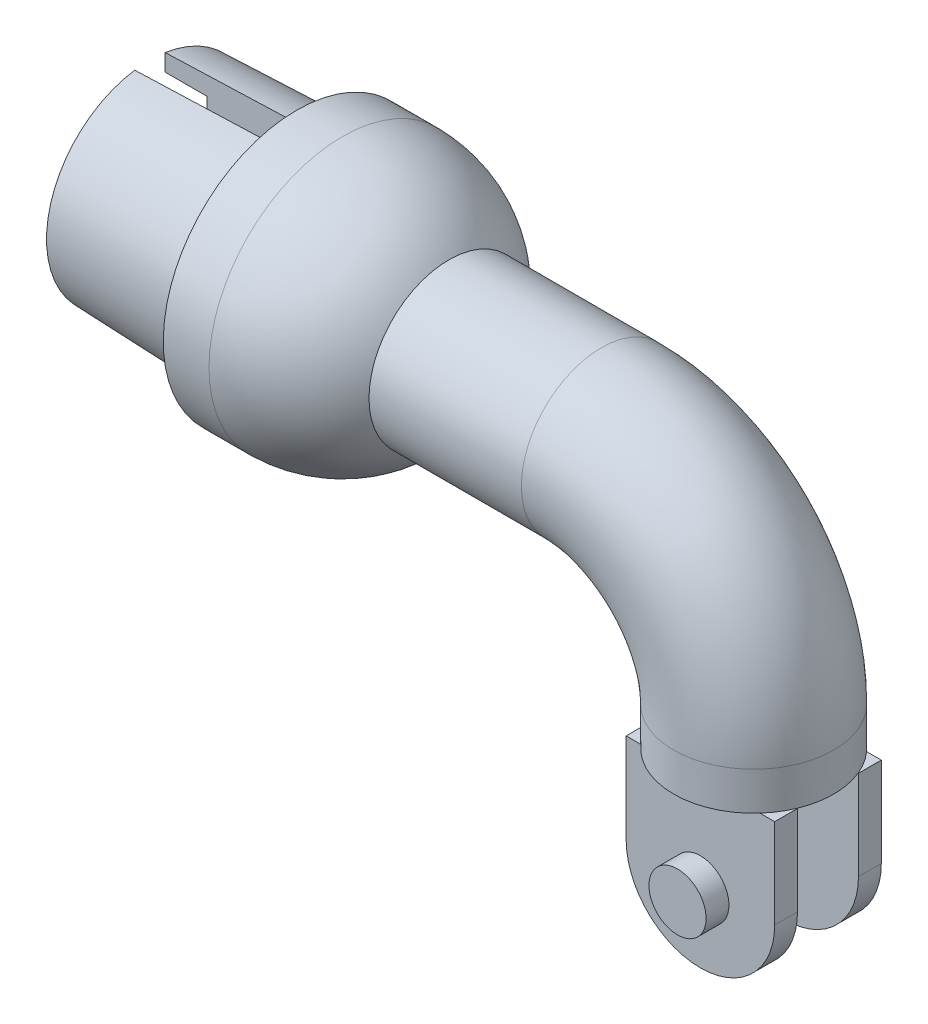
ISO-10303-21;
HEADER;
FILE_DESCRIPTION(('STEP AP214'),'2;1');
FILE_NAME('part.step','',(''),(''),'','','');
FILE_SCHEMA(('AUTOMOTIVE_DESIGN { 1 0 10303 214 1 1 1 1 }'));
ENDSEC;
DATA;
#1=APPLICATION_CONTEXT('core data for automotive mechanical design processes');
#2=APPLICATION_PROTOCOL_DEFINITION('international standard','automotive_design',2000,#1);
#3=PRODUCT_CONTEXT('',#1,'mechanical');
#4=PRODUCT('Part','Part','',(#3));
#5=PRODUCT_RELATED_PRODUCT_CATEGORY('part','',(#4));
#6=PRODUCT_DEFINITION_FORMATION('','',#4);
#7=PRODUCT_DEFINITION_CONTEXT('part definition',#1,'design');
#8=PRODUCT_DEFINITION('design','',#6,#7);
#9=PRODUCT_DEFINITION_SHAPE('','',#8);
#10=(LENGTH_UNIT() NAMED_UNIT(*) SI_UNIT(.MILLI.,.METRE.));
#11=(NAMED_UNIT(*) PLANE_ANGLE_UNIT() SI_UNIT($,.RADIAN.));
#12=(NAMED_UNIT(*) SI_UNIT($,.STERADIAN.) SOLID_ANGLE_UNIT());
#13=UNCERTAINTY_MEASURE_WITH_UNIT(LENGTH_MEASURE(1.E-05),#10,'distance_accuracy_value','');
#14=(GEOMETRIC_REPRESENTATION_CONTEXT(3) GLOBAL_UNCERTAINTY_ASSIGNED_CONTEXT((#13)) GLOBAL_UNIT_ASSIGNED_CONTEXT((#10,
#11,#12)) REPRESENTATION_CONTEXT('',''));
#15=CARTESIAN_POINT('',(0.,0.,0.));
#16=DIRECTION('',(0.,0.,1.));
#17=DIRECTION('',(1.,0.,0.));
#18=AXIS2_PLACEMENT_3D('',#15,#16,#17);
#19=CARTESIAN_POINT('',(0.,6.35,0.));
#20=DIRECTION('',(0.,1.,0.));
#21=DIRECTION('',(0.,0.,1.));
#22=AXIS2_PLACEMENT_3D('',#19,#20,#21);
#23=PLANE('',#22);
#24=CARTESIAN_POINT('',(0.,6.35,0.));
#25=DIRECTION('',(0.,1.,0.));
#26=DIRECTION('',(0.,0.,1.));
#27=AXIS2_PLACEMENT_3D('',#24,#25,#26);
#28=CIRCLE('',#27,5.334);
#29=CARTESIAN_POINT('',(4.93178791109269,6.35,2.032));
#30=VERTEX_POINT('',#29);
#31=CARTESIAN_POINT('',(4.93178791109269,6.35,-2.032));
#32=VERTEX_POINT('',#31);
#33=EDGE_CURVE('E43',#30,#32,#28,.T.);
#34=ORIENTED_EDGE('',*,*,#33,.F.);
#35=DIRECTION('',(1.,0.,0.));
#36=VECTOR('',#35,1.);
#37=CARTESIAN_POINT('',(-4.953,6.34999999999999,2.032));
#38=LINE('',#37,#36);
#39=CARTESIAN_POINT('',(2.60272549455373,6.34999999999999,2.032));
#40=VERTEX_POINT('',#39);
#41=EDGE_CURVE('E550',#40,#30,#38,.T.);
#42=ORIENTED_EDGE('',*,*,#41,.F.);
#43=CARTESIAN_POINT('',(0.,6.35,0.));
#44=DIRECTION('',(0.,1.,0.));
#45=DIRECTION('',(0.,0.,1.));
#46=AXIS2_PLACEMENT_3D('',#43,#44,#45);
#47=CIRCLE('',#46,3.302);
#48=CARTESIAN_POINT('',(2.60272549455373,6.34999999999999,-2.032));
#49=VERTEX_POINT('',#48);
#50=EDGE_CURVE('E453',#40,#49,#47,.T.);
#51=ORIENTED_EDGE('',*,*,#50,.T.);
#52=DIRECTION('',(1.,0.,0.));
#53=VECTOR('',#52,1.);
#54=CARTESIAN_POINT('',(-4.953,6.34999999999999,-2.032));
#55=LINE('',#54,#53);
#56=EDGE_CURVE('E286',#49,#32,#55,.T.);
#57=ORIENTED_EDGE('',*,*,#56,.T.);
#58=EDGE_LOOP('',(#34,#42,#51,#57));
#59=FACE_BOUND('',#58,.T.);
#60=ADVANCED_FACE('F28',(#59),#23,.F.);
#61=DIRECTION('',(1.,0.,0.));
#62=VECTOR('',#61,1.);
#63=CARTESIAN_POINT('',(-4.953,6.34999999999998,3.556));
#64=LINE('',#63,#62);
#65=CARTESIAN_POINT('',(-3.97572886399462,6.35,3.556));
#66=VERTEX_POINT('',#65);
#67=CARTESIAN_POINT('',(3.97572886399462,6.35,3.556));
#68=VERTEX_POINT('',#67);
#69=EDGE_CURVE('E50',#66,#68,#64,.T.);
#70=ORIENTED_EDGE('',*,*,#69,.T.);
#71=EDGE_CURVE('E536',#66,#68,#28,.T.);
#72=ORIENTED_EDGE('',*,*,#71,.F.);
#73=EDGE_LOOP('',(#70,#72));
#74=FACE_BOUND('',#73,.T.);
#75=ADVANCED_FACE('F573',(#74),#23,.F.);
#76=CARTESIAN_POINT('',(0.,0.380999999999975,-3.55599999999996));
#77=DIRECTION('',(0.,0.,1.));
#78=DIRECTION('',(0.,-1.,0.));
#79=AXIS2_PLACEMENT_3D('',#76,#77,#78);
#80=PLANE('',#79);
#81=DIRECTION('',(0.,-1.,0.));
#82=VECTOR('',#81,1.);
#83=CARTESIAN_POINT('',(-4.953,6.34999999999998,-3.556));
#84=LINE('',#83,#82);
#85=CARTESIAN_POINT('',(-4.953,6.34999999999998,-3.556));
#86=VERTEX_POINT('',#85);
#87=CARTESIAN_POINT('',(-4.953,0.380999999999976,-3.55599999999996));
#88=VERTEX_POINT('',#87);
#89=EDGE_CURVE('E260',#86,#88,#84,.T.);
#90=ORIENTED_EDGE('',*,*,#89,.F.);
#91=DIRECTION('',(1.,0.,0.));
#92=VECTOR('',#91,1.);
#93=CARTESIAN_POINT('',(-4.953,6.34999999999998,-3.556));
#94=LINE('',#93,#92);
#95=CARTESIAN_POINT('',(-3.97572886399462,6.34999999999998,-3.556));
#96=VERTEX_POINT('',#95);
#97=EDGE_CURVE('E269',#86,#96,#94,.T.);
#98=ORIENTED_EDGE('',*,*,#97,.T.);
#99=CARTESIAN_POINT('',(3.97572886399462,6.34999999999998,-3.556));
#100=VERTEX_POINT('',#99);
#101=EDGE_CURVE('E36',#96,#100,#94,.T.);
#102=ORIENTED_EDGE('',*,*,#101,.T.);
#103=CARTESIAN_POINT('',(4.95299999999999,6.34999999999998,-3.556));
#104=VERTEX_POINT('',#103);
#105=EDGE_CURVE('E268',#100,#104,#94,.T.);
#106=ORIENTED_EDGE('',*,*,#105,.T.);
#107=DIRECTION('',(0.,1.,0.));
#108=VECTOR('',#107,1.);
#109=CARTESIAN_POINT('',(4.953,0.380999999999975,-3.55599999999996));
#110=LINE('',#109,#108);
#111=CARTESIAN_POINT('',(4.953,0.380999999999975,-3.55599999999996));
#112=VERTEX_POINT('',#111);
#113=EDGE_CURVE('E265',#112,#104,#110,.T.);
#114=ORIENTED_EDGE('',*,*,#113,.F.);
#115=CARTESIAN_POINT('',(0.,0.380999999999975,-3.55599999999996));
#116=DIRECTION('',(0.,0.,1.));
#117=DIRECTION('',(0.,-1.,0.));
#118=AXIS2_PLACEMENT_3D('',#115,#116,#117);
#119=CIRCLE('',#118,4.953);
#120=EDGE_CURVE('E263',#88,#112,#119,.T.);
#121=ORIENTED_EDGE('',*,*,#120,.F.);
#122=EDGE_LOOP('',(#90,#98,#102,#106,#114,#121));
#123=FACE_BOUND('',#122,.T.);
#124=CARTESIAN_POINT('',(0.,0.,-3.55599999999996));
#125=DIRECTION('',(0.,0.,1.));
#126=DIRECTION('',(0.,-1.,0.));
#127=AXIS2_PLACEMENT_3D('',#124,#125,#126);
#128=CIRCLE('',#127,1.905);
#129=CARTESIAN_POINT('',(0.,-1.90500000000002,-3.55599999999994));
#130=VERTEX_POINT('',#129);
#131=EDGE_CURVE('E11',#130,#130,#128,.F.);
#132=ORIENTED_EDGE('',*,*,#131,.F.);
#133=EDGE_LOOP('',(#132));
#134=FACE_BOUND('',#133,.T.);
#135=ADVANCED_FACE('F522',(#123,#134),#80,.F.);
#136=ORIENTED_EDGE('',*,*,#101,.F.);
#137=EDGE_CURVE('E481',#100,#96,#28,.T.);
#138=ORIENTED_EDGE('',*,*,#137,.F.);
#139=EDGE_LOOP('',(#136,#138));
#140=FACE_BOUND('',#139,.T.);
#141=ADVANCED_FACE('F529',(#140),#23,.F.);
#142=CARTESIAN_POINT('',(-40.259,19.05,0.));
#143=DIRECTION('',(-1.,0.,0.));
#144=DIRECTION('',(0.,-1.,0.));
#145=AXIS2_PLACEMENT_3D('',#142,#143,#144);
#146=PLANE('',#145);
#147=DIRECTION('',(0.,-1.,0.));
#148=VECTOR('',#147,1.);
#149=CARTESIAN_POINT('',(-40.259,27.94,1.016));
#150=LINE('',#149,#148);
#151=CARTESIAN_POINT('',(-40.259,13.3615198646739,1.016));
#152=VERTEX_POINT('',#151);
#153=CARTESIAN_POINT('',(-40.259,12.2277287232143,1.016));
#154=VERTEX_POINT('',#153);
#155=EDGE_CURVE('E308',#152,#154,#150,.T.);
#156=ORIENTED_EDGE('',*,*,#155,.T.);
#157=CARTESIAN_POINT('',(-40.259,19.05,0.));
#158=DIRECTION('',(-1.,0.,0.));
#159=DIRECTION('',(0.,-1.,0.));
#160=AXIS2_PLACEMENT_3D('',#157,#158,#159);
#161=CIRCLE('',#160,6.8975097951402);
#162=CARTESIAN_POINT('',(-40.259,25.8722712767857,1.016));
#163=VERTEX_POINT('',#162);
#164=EDGE_CURVE('E468',#154,#163,#161,.T.);
#165=ORIENTED_EDGE('',*,*,#164,.T.);
#166=CARTESIAN_POINT('',(-40.259,24.7384801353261,1.016));
#167=VERTEX_POINT('',#166);
#168=EDGE_CURVE('E311',#163,#167,#150,.T.);
#169=ORIENTED_EDGE('',*,*,#168,.T.);
#170=CARTESIAN_POINT('',(-40.259,19.05,0.));
#171=DIRECTION('',(-1.,0.,0.));
#172=DIRECTION('',(0.,-1.,0.));
#173=AXIS2_PLACEMENT_3D('',#170,#171,#172);
#174=CIRCLE('',#173,5.7785);
#175=EDGE_CURVE('E432',#152,#167,#174,.T.);
#176=ORIENTED_EDGE('',*,*,#175,.F.);
#177=EDGE_LOOP('',(#156,#165,#169,#176));
#178=FACE_BOUND('',#177,.T.);
#179=ADVANCED_FACE('F591',(#178),#146,.T.);
#180=CARTESIAN_POINT('',(-37.465,19.05,0.));
#181=DIRECTION('',(-1.,0.,0.));
#182=DIRECTION('',(0.,-1.,0.));
#183=AXIS2_PLACEMENT_3D('',#180,#181,#182);
#184=CYLINDRICAL_SURFACE('',#183,5.7785);
#185=ORIENTED_EDGE('',*,*,#175,.T.);
#186=DIRECTION('',(-1.,0.,0.));
#187=VECTOR('',#186,1.);
#188=CARTESIAN_POINT('',(-37.465,24.7384801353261,1.016));
#189=LINE('',#188,#187);
#190=CARTESIAN_POINT('',(-37.465,24.7384801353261,1.016));
#191=VERTEX_POINT('',#190);
#192=EDGE_CURVE('E406',#167,#191,#189,.F.);
#193=ORIENTED_EDGE('',*,*,#192,.T.);
#194=CARTESIAN_POINT('',(-37.465,19.05,0.));
#195=DIRECTION('',(-1.,0.,0.));
#196=DIRECTION('',(0.,-1.,0.));
#197=AXIS2_PLACEMENT_3D('',#194,#195,#196);
#198=CIRCLE('',#197,5.7785);
#199=CARTESIAN_POINT('',(-37.465,13.3615198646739,1.016));
#200=VERTEX_POINT('',#199);
#201=EDGE_CURVE('E435',#200,#191,#198,.T.);
#202=ORIENTED_EDGE('',*,*,#201,.F.);
#203=DIRECTION('',(-1.,0.,0.));
#204=VECTOR('',#203,1.);
#205=CARTESIAN_POINT('',(-37.465,13.3615198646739,1.016));
#206=LINE('',#205,#204);
#207=EDGE_CURVE('E405',#200,#152,#206,.T.);
#208=ORIENTED_EDGE('',*,*,#207,.T.);
#209=EDGE_LOOP('',(#185,#193,#202,#208));
#210=FACE_BOUND('',#209,.T.);
#211=ADVANCED_FACE('F596',(#210),#184,.F.);
#212=CARTESIAN_POINT('',(-37.465,19.05,0.));
#213=DIRECTION('',(-1.,0.,0.));
#214=DIRECTION('',(0.,-1.,0.));
#215=AXIS2_PLACEMENT_3D('',#212,#213,#214);
#216=PLANE('',#215);
#217=DIRECTION('',(0.,1.,0.));
#218=VECTOR('',#217,1.);
#219=CARTESIAN_POINT('',(-37.465,19.05,1.016));
#220=LINE('',#219,#218);
#221=CARTESIAN_POINT('',(-37.465,14.1932934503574,1.016));
#222=VERTEX_POINT('',#221);
#223=EDGE_CURVE('E416',#200,#222,#220,.T.);
#224=ORIENTED_EDGE('',*,*,#223,.F.);
#225=ORIENTED_EDGE('',*,*,#201,.T.);
#226=CARTESIAN_POINT('',(-37.465,23.9067065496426,1.016));
#227=VERTEX_POINT('',#226);
#228=EDGE_CURVE('E492',#227,#191,#220,.T.);
#229=ORIENTED_EDGE('',*,*,#228,.F.);
#230=CARTESIAN_POINT('',(-37.465,19.05,0.));
#231=DIRECTION('',(-1.,0.,0.));
#232=DIRECTION('',(0.,-1.,0.));
#233=AXIS2_PLACEMENT_3D('',#230,#231,#232);
#234=CIRCLE('',#233,4.96183983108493);
#235=EDGE_CURVE('E457',#222,#227,#234,.T.);
#236=ORIENTED_EDGE('',*,*,#235,.F.);
#237=EDGE_LOOP('',(#224,#225,#229,#236));
#238=FACE_BOUND('',#237,.T.);
#239=ADVANCED_FACE('F653',(#238),#216,.T.);
#240=CARTESIAN_POINT('',(-30.4090842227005,19.05,0.));
#241=DIRECTION('',(1.,0.,0.));
#242=DIRECTION('',(0.,-1.,0.));
#243=AXIS2_PLACEMENT_3D('',#240,#241,#242);
#244=CONICAL_SURFACE('',#243,5.20823783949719,0.0349065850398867);
#245=CARTESIAN_POINT('',(-45.5995649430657,14.483894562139,1.016));
#246=CARTESIAN_POINT('',(-42.3703496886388,14.3683953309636,1.016));
#247=CARTESIAN_POINT('',(-39.1411284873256,14.2530628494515,1.016));
#248=CARTESIAN_POINT('',(-32.6826741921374,14.0227313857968,1.016));
#249=CARTESIAN_POINT('',(-29.4534410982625,13.9077324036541,1.016));
#250=CARTESIAN_POINT('',(-26.2242020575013,13.7929001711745,1.016));
#251=B_SPLINE_CURVE_WITH_KNOTS('',3,(#245,#246,#247,#248,#249,#250),.UNSPECIFIED.,.F.,.F.,(4,2,
4),(0.,9.69384032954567,19.3876806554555),.UNSPECIFIED.);
#252=CARTESIAN_POINT('',(-31.115,13.9669580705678,1.016));
#253=VERTEX_POINT('',#252);
#254=EDGE_CURVE('E381',#222,#253,#251,.T.);
#255=ORIENTED_EDGE('',*,*,#254,.F.);
#256=ORIENTED_EDGE('',*,*,#235,.T.);
#257=CARTESIAN_POINT('',(-26.2242020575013,24.3070998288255,1.016));
#258=CARTESIAN_POINT('',(-29.4534410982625,24.1922675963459,1.016));
#259=CARTESIAN_POINT('',(-32.6826741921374,24.0772686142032,1.016));
#260=CARTESIAN_POINT('',(-39.1411284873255,23.8469371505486,1.016));
#261=CARTESIAN_POINT('',(-42.3703496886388,23.7316046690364,1.016));
#262=CARTESIAN_POINT('',(-45.5995649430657,23.616105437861,1.016));
#263=B_SPLINE_CURVE_WITH_KNOTS('',3,(#257,#258,#259,#260,#261,#262),.UNSPECIFIED.,.F.,.F.,(4,2,
4),(0.,9.69384032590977,19.3876806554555),.UNSPECIFIED.);
#264=CARTESIAN_POINT('',(-31.115,24.1330419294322,1.016));
#265=VERTEX_POINT('',#264);
#266=EDGE_CURVE('E400',#265,#227,#263,.T.);
#267=ORIENTED_EDGE('',*,*,#266,.F.);
#268=CARTESIAN_POINT('',(-31.115,19.05,0.));
#269=DIRECTION('',(1.,0.,0.));
#270=DIRECTION('',(0.,0.,-1.));
#271=AXIS2_PLACEMENT_3D('',#268,#269,#270);
#272=CIRCLE('',#271,5.18358671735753);
#273=CARTESIAN_POINT('',(-31.115,24.1330419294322,-1.016));
#274=VERTEX_POINT('',#273);
#275=EDGE_CURVE('E429',#274,#265,#272,.T.);
#276=ORIENTED_EDGE('',*,*,#275,.F.);
#277=CARTESIAN_POINT('',(-45.5995649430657,23.616105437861,-1.016));
#278=CARTESIAN_POINT('',(-42.3703496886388,23.7316046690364,-1.016));
#279=CARTESIAN_POINT('',(-39.1411284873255,23.8469371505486,-1.016));
#280=CARTESIAN_POINT('',(-32.6826741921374,24.0772686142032,-1.016));
#281=CARTESIAN_POINT('',(-29.4534410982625,24.1922675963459,-1.016));
#282=CARTESIAN_POINT('',(-26.2242020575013,24.3070998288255,-1.016));
#283=B_SPLINE_CURVE_WITH_KNOTS('',3,(#277,#278,#279,#280,#281,#282),.UNSPECIFIED.,.F.,.F.,(4,2,
4),(0.,9.69384032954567,19.3876806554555),.UNSPECIFIED.);
#284=CARTESIAN_POINT('',(-37.465,23.9067065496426,-1.016));
#285=VERTEX_POINT('',#284);
#286=EDGE_CURVE('E345',#285,#274,#283,.T.);
#287=ORIENTED_EDGE('',*,*,#286,.F.);
#288=CARTESIAN_POINT('',(-37.465,14.1932934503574,-1.016));
#289=VERTEX_POINT('',#288);
#290=EDGE_CURVE('E438',#285,#289,#234,.T.);
#291=ORIENTED_EDGE('',*,*,#290,.T.);
#292=CARTESIAN_POINT('',(-26.2242020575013,13.7929001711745,-1.016));
#293=CARTESIAN_POINT('',(-29.4534410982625,13.9077324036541,-1.016));
#294=CARTESIAN_POINT('',(-32.6826741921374,14.0227313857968,-1.016));
#295=CARTESIAN_POINT('',(-39.1411284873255,14.2530628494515,-1.016));
#296=CARTESIAN_POINT('',(-42.3703496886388,14.3683953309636,-1.016));
#297=CARTESIAN_POINT('',(-45.5995649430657,14.483894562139,-1.016));
#298=B_SPLINE_CURVE_WITH_KNOTS('',3,(#292,#293,#294,#295,#296,#297),.UNSPECIFIED.,.F.,.F.,(4,2,
4),(0.,9.69384032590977,19.3876806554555),.UNSPECIFIED.);
#299=CARTESIAN_POINT('',(-31.115,13.9669580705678,-1.016));
#300=VERTEX_POINT('',#299);
#301=EDGE_CURVE('E315',#300,#289,#298,.T.);
#302=ORIENTED_EDGE('',*,*,#301,.F.);
#303=EDGE_CURVE('E422',#253,#300,#272,.T.);
#304=ORIENTED_EDGE('',*,*,#303,.F.);
#305=EDGE_LOOP('',(#255,#256,#267,#276,#287,#291,#302,#304));
#306=FACE_BOUND('',#305,.T.);
#307=CARTESIAN_POINT('',(-28.448,19.05,0.));
#308=DIRECTION('',(-1.,0.,0.));
#309=DIRECTION('',(0.,-1.,0.));
#310=AXIS2_PLACEMENT_3D('',#307,#308,#309);
#311=CIRCLE('',#310,5.27672040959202);
#312=CARTESIAN_POINT('',(-28.448,13.773279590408,0.));
#313=VERTEX_POINT('',#312);
#314=EDGE_CURVE('E442',#313,#313,#311,.T.);
#315=ORIENTED_EDGE('',*,*,#314,.F.);
#316=EDGE_LOOP('',(#315));
#317=FACE_BOUND('',#316,.T.);
#318=ADVANCED_FACE('F324',(#306,#317),#244,.F.);
#319=CARTESIAN_POINT('',(-10.16,19.05,0.));
#320=DIRECTION('',(-1.,0.,0.));
#321=DIRECTION('',(0.,-1.,0.));
#322=AXIS2_PLACEMENT_3D('',#319,#320,#321);
#323=CYLINDRICAL_SURFACE('',#322,5.334);
#324=CARTESIAN_POINT('',(-20.32,19.05,0.));
#325=DIRECTION('',(-1.,0.,0.));
#326=DIRECTION('',(0.,0.,1.));
#327=AXIS2_PLACEMENT_3D('',#324,#325,#326);
#328=CIRCLE('',#327,5.334);
#329=CARTESIAN_POINT('',(-20.32,19.05,5.334));
#330=VERTEX_POINT('',#329);
#331=EDGE_CURVE('E467',#330,#330,#328,.T.);
#332=ORIENTED_EDGE('',*,*,#331,.F.);
#333=EDGE_LOOP('',(#332));
#334=FACE_BOUND('',#333,.T.);
#335=CARTESIAN_POINT('',(-10.16,19.05,0.));
#336=DIRECTION('',(-1.,0.,0.));
#337=DIRECTION('',(0.,0.,1.));
#338=AXIS2_PLACEMENT_3D('',#335,#336,#337);
#339=CIRCLE('',#338,5.334);
#340=CARTESIAN_POINT('',(-10.16,24.384,0.));
#341=VERTEX_POINT('',#340);
#342=EDGE_CURVE('E484',#341,#341,#339,.T.);
#343=ORIENTED_EDGE('',*,*,#342,.T.);
#344=EDGE_LOOP('',(#343));
#345=FACE_BOUND('',#344,.T.);
#346=ADVANCED_FACE('F30',(#334,#345),#323,.T.);
#347=CARTESIAN_POINT('',(-10.16,8.89,0.));
#348=DIRECTION('',(0.,0.,1.));
#349=DIRECTION('',(1.,0.,0.));
#350=AXIS2_PLACEMENT_3D('',#347,#348,#349);
#351=TOROIDAL_SURFACE('',#350,10.16,5.334);
#352=CARTESIAN_POINT('',(0.,8.89,0.));
#353=DIRECTION('',(0.,1.,0.));
#354=DIRECTION('',(0.,0.,1.));
#355=AXIS2_PLACEMENT_3D('',#352,#353,#354);
#356=CIRCLE('',#355,5.334);
#357=CARTESIAN_POINT('',(5.334,8.89,0.));
#358=VERTEX_POINT('',#357);
#359=EDGE_CURVE('E480',#358,#358,#356,.T.);
#360=CARTESIAN_POINT('',(-10.16,8.89,0.));
#361=DIRECTION('',(0.,0.,1.));
#362=DIRECTION('',(1.,0.,0.));
#363=AXIS2_PLACEMENT_3D('',#360,#361,#362);
#364=CIRCLE('',#363,15.494);
#365=EDGE_CURVE('',#358,#341,#364,.T.);
#366=ORIENTED_EDGE('',*,*,#359,.T.);
#367=ORIENTED_EDGE('',*,*,#342,.F.);
#368=ORIENTED_EDGE('',*,*,#365,.T.);
#369=ORIENTED_EDGE('',*,*,#365,.F.);
#370=EDGE_LOOP('',(#366,#368,#367,#369));
#371=FACE_BOUND('',#370,.T.);
#372=ADVANCED_FACE('F588',(#371),#351,.T.);
#373=CARTESIAN_POINT('',(0.,8.89,0.));
#374=DIRECTION('',(0.,-1.,0.));
#375=DIRECTION('',(0.,0.,-1.));
#376=AXIS2_PLACEMENT_3D('',#373,#374,#375);
#377=CYLINDRICAL_SURFACE('',#376,5.334);
#378=ORIENTED_EDGE('',*,*,#359,.F.);
#379=EDGE_LOOP('',(#378));
#380=FACE_BOUND('',#379,.T.);
#381=EDGE_CURVE('E477',#32,#100,#28,.T.);
#382=ORIENTED_EDGE('',*,*,#381,.T.);
#383=ORIENTED_EDGE('',*,*,#137,.T.);
#384=CARTESIAN_POINT('',(-4.93178791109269,6.34999999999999,-2.032));
#385=VERTEX_POINT('',#384);
#386=EDGE_CURVE('E532',#96,#385,#28,.T.);
#387=ORIENTED_EDGE('',*,*,#386,.T.);
#388=CARTESIAN_POINT('',(-4.93178791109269,6.35,2.032));
#389=VERTEX_POINT('',#388);
#390=EDGE_CURVE('E537',#385,#389,#28,.T.);
#391=ORIENTED_EDGE('',*,*,#390,.T.);
#392=CARTESIAN_POINT('',(0.,6.35,0.));
#393=DIRECTION('',(0.,-1.,0.));
#394=DIRECTION('',(0.,0.,-1.));
#395=AXIS2_PLACEMENT_3D('',#392,#393,#394);
#396=CIRCLE('',#395,5.334);
#397=EDGE_CURVE('E213',#66,#389,#396,.T.);
#398=ORIENTED_EDGE('',*,*,#397,.F.);
#399=ORIENTED_EDGE('',*,*,#71,.T.);
#400=EDGE_CURVE('E256',#30,#68,#396,.T.);
#401=ORIENTED_EDGE('',*,*,#400,.F.);
#402=ORIENTED_EDGE('',*,*,#33,.T.);
#403=EDGE_LOOP('',(#382,#383,#387,#391,#398,#399,#401,#402));
#404=FACE_BOUND('',#403,.T.);
#405=ADVANCED_FACE('F533',(#380,#404),#377,.T.);
#406=CARTESIAN_POINT('',(-2.60272549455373,6.34999999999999,-2.032));
#407=VERTEX_POINT('',#406);
#408=CARTESIAN_POINT('',(-2.60272549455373,6.35,2.032));
#409=VERTEX_POINT('',#408);
#410=EDGE_CURVE('E462',#407,#409,#47,.T.);
#411=ORIENTED_EDGE('',*,*,#410,.T.);
#412=EDGE_CURVE('E244',#389,#409,#38,.T.);
#413=ORIENTED_EDGE('',*,*,#412,.F.);
#414=ORIENTED_EDGE('',*,*,#390,.F.);
#415=EDGE_CURVE('E496',#385,#407,#55,.T.);
#416=ORIENTED_EDGE('',*,*,#415,.T.);
#417=EDGE_LOOP('',(#411,#413,#414,#416));
#418=FACE_BOUND('',#417,.T.);
#419=ADVANCED_FACE('F544',(#418),#23,.F.);
#420=CARTESIAN_POINT('',(-27.432,19.05,0.));
#421=DIRECTION('',(0.,0.,1.));
#422=DIRECTION('',(1.,0.,0.));
#423=AXIS2_PLACEMENT_3D('',#420,#421,#422);
#424=SPHERICAL_SURFACE('',#423,8.89);
#425=CARTESIAN_POINT('',(-27.432,19.05,0.));
#426=DIRECTION('',(-1.,0.,0.));
#427=DIRECTION('',(0.,0.,1.));
#428=AXIS2_PLACEMENT_3D('',#425,#426,#427);
#429=SPHERICAL_SURFACE('',#428,8.89);
#430=ORIENTED_EDGE('',*,*,#331,.T.);
#431=EDGE_LOOP('',(#430));
#432=FACE_BOUND('',#431,.T.);
#433=CARTESIAN_POINT('',(-27.432,19.05,0.));
#434=DIRECTION('',(1.,0.,0.));
#435=DIRECTION('',(0.,1.,0.));
#436=AXIS2_PLACEMENT_3D('',#433,#434,#435);
#437=CIRCLE('',#436,8.89);
#438=CARTESIAN_POINT('',(-27.432,27.94,0.));
#439=VERTEX_POINT('',#438);
#440=EDGE_CURVE('E474',#439,#439,#437,.T.);
#441=ORIENTED_EDGE('',*,*,#440,.T.);
#442=EDGE_LOOP('',(#441));
#443=FACE_BOUND('',#442,.T.);
#444=ADVANCED_FACE('F581',(#432,#443),#429,.T.);
#445=CARTESIAN_POINT('',(-36.1721679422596,19.05,0.));
#446=DIRECTION('',(1.,0.,0.));
#447=DIRECTION('',(0.,1.,0.));
#448=AXIS2_PLACEMENT_3D('',#445,#446,#447);
#449=CYLINDRICAL_SURFACE('',#448,8.89);
#450=CARTESIAN_POINT('',(-30.48,19.05,0.));
#451=DIRECTION('',(1.,0.,0.));
#452=DIRECTION('',(0.,1.,0.));
#453=AXIS2_PLACEMENT_3D('',#450,#451,#452);
#454=CIRCLE('',#453,8.89);
#455=CARTESIAN_POINT('',(-30.48,27.94,0.));
#456=VERTEX_POINT('',#455);
#457=EDGE_CURVE('E471',#456,#456,#454,.T.);
#458=ORIENTED_EDGE('',*,*,#457,.T.);
#459=EDGE_LOOP('',(#458));
#460=FACE_BOUND('',#459,.T.);
#461=ORIENTED_EDGE('',*,*,#440,.F.);
#462=EDGE_LOOP('',(#461));
#463=FACE_BOUND('',#462,.T.);
#464=ADVANCED_FACE('F586',(#460,#463),#449,.T.);
#465=CARTESIAN_POINT('',(-30.48,27.94,0.));
#466=DIRECTION('',(-1.,0.,0.));
#467=DIRECTION('',(0.,-1.,0.));
#468=AXIS2_PLACEMENT_3D('',#465,#466,#467);
#469=PLANE('',#468);
#470=CARTESIAN_POINT('',(-30.48,19.05,0.));
#471=DIRECTION('',(-1.,0.,0.));
#472=DIRECTION('',(0.,-1.,0.));
#473=AXIS2_PLACEMENT_3D('',#470,#471,#472);
#474=CIRCLE('',#473,7.239);
#475=CARTESIAN_POINT('',(-30.48,11.811,0.));
#476=VERTEX_POINT('',#475);
#477=EDGE_CURVE('E463',#476,#476,#474,.T.);
#478=ORIENTED_EDGE('',*,*,#477,.F.);
#479=EDGE_LOOP('',(#478));
#480=FACE_BOUND('',#479,.T.);
#481=ORIENTED_EDGE('',*,*,#457,.F.);
#482=EDGE_LOOP('',(#481));
#483=FACE_BOUND('',#482,.T.);
#484=ADVANCED_FACE('F366',(#480,#483),#469,.T.);
#485=CARTESIAN_POINT('',(-30.48,19.05,0.));
#486=DIRECTION('',(1.,0.,0.));
#487=DIRECTION('',(0.,-1.,0.));
#488=AXIS2_PLACEMENT_3D('',#485,#486,#487);
#489=CONICAL_SURFACE('',#488,7.239,0.0349065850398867);
#490=ORIENTED_EDGE('',*,*,#164,.F.);
#491=CARTESIAN_POINT('',(-51.4974364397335,12.624777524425,1.016));
#492=CARTESIAN_POINT('',(-47.0067210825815,12.4660270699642,1.016));
#493=CARTESIAN_POINT('',(-42.5160016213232,12.3073928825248,1.016));
#494=CARTESIAN_POINT('',(-33.534554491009,11.9903570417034,1.016));
#495=CARTESIAN_POINT('',(-29.0438268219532,11.8319553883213,1.016));
#496=CARTESIAN_POINT('',(-24.5530950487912,11.6736700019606,1.01600000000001));
#497=B_SPLINE_CURVE_WITH_KNOTS('',3,(#491,#492,#493,#494,#495,#496),.UNSPECIFIED.,.F.,.F.,(4,2,
4),(0.,13.4805613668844,26.9611227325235),.UNSPECIFIED.);
#498=CARTESIAN_POINT('',(-31.115,11.9050499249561,1.016));
#499=VERTEX_POINT('',#498);
#500=EDGE_CURVE('E380',#154,#499,#497,.T.);
#501=ORIENTED_EDGE('',*,*,#500,.T.);
#502=CARTESIAN_POINT('',(-31.115,19.05,0.));
#503=DIRECTION('',(1.,0.,0.));
#504=DIRECTION('',(0.,0.,-1.));
#505=AXIS2_PLACEMENT_3D('',#502,#503,#504);
#506=CIRCLE('',#505,7.21682531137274);
#507=CARTESIAN_POINT('',(-31.115,11.9050499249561,-1.016));
#508=VERTEX_POINT('',#507);
#509=EDGE_CURVE('E425',#499,#508,#506,.T.);
#510=ORIENTED_EDGE('',*,*,#509,.T.);
#511=CARTESIAN_POINT('',(-24.5530950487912,11.6736700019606,-1.016));
#512=CARTESIAN_POINT('',(-29.0438268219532,11.8319553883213,-1.016));
#513=CARTESIAN_POINT('',(-33.534554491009,11.9903570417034,-1.016));
#514=CARTESIAN_POINT('',(-42.5160016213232,12.3073928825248,-1.016));
#515=CARTESIAN_POINT('',(-47.0067210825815,12.4660270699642,-1.016));
#516=CARTESIAN_POINT('',(-51.4974364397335,12.624777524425,-1.016));
#517=B_SPLINE_CURVE_WITH_KNOTS('',3,(#511,#512,#513,#514,#515,#516),.UNSPECIFIED.,.F.,.F.,(4,2,
4),(0.,13.4805613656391,26.9611227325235),.UNSPECIFIED.);
#518=CARTESIAN_POINT('',(-40.259,12.2277287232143,-1.016));
#519=VERTEX_POINT('',#518);
#520=EDGE_CURVE('E356',#508,#519,#517,.T.);
#521=ORIENTED_EDGE('',*,*,#520,.T.);
#522=CARTESIAN_POINT('',(-40.259,25.8722712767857,-1.016));
#523=VERTEX_POINT('',#522);
#524=EDGE_CURVE('E460',#523,#519,#161,.T.);
#525=ORIENTED_EDGE('',*,*,#524,.F.);
#526=CARTESIAN_POINT('',(-51.4974364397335,25.4752224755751,-1.016));
#527=CARTESIAN_POINT('',(-47.0067210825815,25.6339729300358,-1.016));
#528=CARTESIAN_POINT('',(-42.5160016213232,25.7926071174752,-1.016));
#529=CARTESIAN_POINT('',(-33.534554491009,26.1096429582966,-1.016));
#530=CARTESIAN_POINT('',(-29.0438268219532,26.2680446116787,-1.016));
#531=CARTESIAN_POINT('',(-24.5530950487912,26.4263299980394,-1.016));
#532=B_SPLINE_CURVE_WITH_KNOTS('',3,(#526,#527,#528,#529,#530,#531),.UNSPECIFIED.,.F.,.F.,(4,2,
4),(0.,13.4805613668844,26.9611227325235),.UNSPECIFIED.);
#533=CARTESIAN_POINT('',(-31.115,26.1949500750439,-1.016));
#534=VERTEX_POINT('',#533);
#535=EDGE_CURVE('E350',#523,#534,#532,.T.);
#536=ORIENTED_EDGE('',*,*,#535,.T.);
#537=CARTESIAN_POINT('',(-31.115,26.1949500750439,1.016));
#538=VERTEX_POINT('',#537);
#539=EDGE_CURVE('E493',#534,#538,#506,.T.);
#540=ORIENTED_EDGE('',*,*,#539,.T.);
#541=CARTESIAN_POINT('',(-24.5530950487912,26.4263299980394,1.01600000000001));
#542=CARTESIAN_POINT('',(-29.0438268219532,26.2680446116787,1.016));
#543=CARTESIAN_POINT('',(-33.534554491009,26.1096429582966,1.016));
#544=CARTESIAN_POINT('',(-42.5160016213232,25.7926071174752,1.016));
#545=CARTESIAN_POINT('',(-47.0067210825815,25.6339729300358,1.016));
#546=CARTESIAN_POINT('',(-51.4974364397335,25.4752224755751,1.016));
#547=B_SPLINE_CURVE_WITH_KNOTS('',3,(#541,#542,#543,#544,#545,#546),.UNSPECIFIED.,.F.,.F.,(4,2,
4),(0.,13.4805613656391,26.9611227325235),.UNSPECIFIED.);
#548=EDGE_CURVE('E374',#538,#163,#547,.T.);
#549=ORIENTED_EDGE('',*,*,#548,.T.);
#550=EDGE_LOOP('',(#490,#501,#510,#521,#525,#536,#540,#549));
#551=FACE_BOUND('',#550,.T.);
#552=ORIENTED_EDGE('',*,*,#477,.T.);
#553=EDGE_LOOP('',(#552));
#554=FACE_BOUND('',#553,.T.);
#555=ADVANCED_FACE('F361',(#551,#554),#489,.T.);
#556=DIRECTION('',(0.,-1.,0.));
#557=VECTOR('',#556,1.);
#558=CARTESIAN_POINT('',(-40.259,27.94,-1.016));
#559=LINE('',#558,#557);
#560=CARTESIAN_POINT('',(-40.259,24.7384801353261,-1.016));
#561=VERTEX_POINT('',#560);
#562=EDGE_CURVE('E299',#523,#561,#559,.T.);
#563=ORIENTED_EDGE('',*,*,#562,.F.);
#564=ORIENTED_EDGE('',*,*,#524,.T.);
#565=CARTESIAN_POINT('',(-40.259,13.3615198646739,-1.016));
#566=VERTEX_POINT('',#565);
#567=EDGE_CURVE('E297',#566,#519,#559,.T.);
#568=ORIENTED_EDGE('',*,*,#567,.F.);
#569=EDGE_CURVE('E430',#561,#566,#174,.T.);
#570=ORIENTED_EDGE('',*,*,#569,.F.);
#571=EDGE_LOOP('',(#563,#564,#568,#570));
#572=FACE_BOUND('',#571,.T.);
#573=ADVANCED_FACE('F365',(#572),#146,.T.);
#574=CARTESIAN_POINT('',(-10.16,19.05,0.));
#575=DIRECTION('',(-1.,0.,0.));
#576=DIRECTION('',(0.,-1.,0.));
#577=AXIS2_PLACEMENT_3D('',#574,#575,#576);
#578=CYLINDRICAL_SURFACE('',#577,3.302);
#579=CARTESIAN_POINT('',(-21.4212629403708,19.05,0.));
#580=DIRECTION('',(-1.,0.,0.));
#581=DIRECTION('',(0.,0.,1.));
#582=AXIS2_PLACEMENT_3D('',#579,#580,#581);
#583=CIRCLE('',#582,3.302);
#584=CARTESIAN_POINT('',(-21.4212629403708,19.05,3.302));
#585=VERTEX_POINT('',#584);
#586=EDGE_CURVE('E439',#585,#585,#583,.T.);
#587=ORIENTED_EDGE('',*,*,#586,.T.);
#588=EDGE_LOOP('',(#587));
#589=FACE_BOUND('',#588,.T.);
#590=CARTESIAN_POINT('',(-10.16,19.05,0.));
#591=DIRECTION('',(-1.,0.,0.));
#592=DIRECTION('',(0.,-1.,0.));
#593=AXIS2_PLACEMENT_3D('',#590,#591,#592);
#594=CIRCLE('',#593,3.302);
#595=CARTESIAN_POINT('',(-10.16,22.352,0.));
#596=VERTEX_POINT('',#595);
#597=EDGE_CURVE('E443',#596,#596,#594,.T.);
#598=ORIENTED_EDGE('',*,*,#597,.F.);
#599=EDGE_LOOP('',(#598));
#600=FACE_BOUND('',#599,.T.);
#601=ADVANCED_FACE('F677',(#589,#600),#578,.F.);
#602=CARTESIAN_POINT('',(-10.16,8.89,0.));
#603=DIRECTION('',(0.,0.,1.));
#604=DIRECTION('',(1.,0.,0.));
#605=AXIS2_PLACEMENT_3D('',#602,#603,#604);
#606=TOROIDAL_SURFACE('',#605,10.16,3.302);
#607=CARTESIAN_POINT('',(0.,8.89,0.));
#608=DIRECTION('',(0.,-1.,0.));
#609=DIRECTION('',(0.,0.,-1.));
#610=AXIS2_PLACEMENT_3D('',#607,#608,#609);
#611=CIRCLE('',#610,3.302);
#612=CARTESIAN_POINT('',(3.302,8.89,0.));
#613=VERTEX_POINT('',#612);
#614=EDGE_CURVE('E446',#613,#613,#611,.F.);
#615=CARTESIAN_POINT('',(-10.16,8.89,0.));
#616=DIRECTION('',(0.,0.,1.));
#617=DIRECTION('',(1.,0.,0.));
#618=AXIS2_PLACEMENT_3D('',#615,#616,#617);
#619=CIRCLE('',#618,13.462);
#620=EDGE_CURVE('',#613,#596,#619,.T.);
#621=ORIENTED_EDGE('',*,*,#614,.F.);
#622=ORIENTED_EDGE('',*,*,#597,.T.);
#623=ORIENTED_EDGE('',*,*,#620,.T.);
#624=ORIENTED_EDGE('',*,*,#620,.F.);
#625=EDGE_LOOP('',(#621,#623,#622,#624));
#626=FACE_BOUND('',#625,.T.);
#627=ADVANCED_FACE('F680',(#626),#606,.F.);
#628=CARTESIAN_POINT('',(0.,8.89,0.));
#629=DIRECTION('',(0.,-1.,0.));
#630=DIRECTION('',(0.,0.,-1.));
#631=AXIS2_PLACEMENT_3D('',#628,#629,#630);
#632=CYLINDRICAL_SURFACE('',#631,3.302);
#633=ORIENTED_EDGE('',*,*,#614,.T.);
#634=EDGE_LOOP('',(#633));
#635=FACE_BOUND('',#634,.T.);
#636=EDGE_CURVE('E449',#49,#407,#47,.T.);
#637=ORIENTED_EDGE('',*,*,#636,.F.);
#638=ORIENTED_EDGE('',*,*,#50,.F.);
#639=EDGE_CURVE('E895',#409,#40,#47,.T.);
#640=ORIENTED_EDGE('',*,*,#639,.F.);
#641=ORIENTED_EDGE('',*,*,#410,.F.);
#642=EDGE_LOOP('',(#637,#638,#640,#641));
#643=FACE_BOUND('',#642,.T.);
#644=ADVANCED_FACE('F684',(#635,#643),#632,.F.);
#645=CARTESIAN_POINT('',(-27.432,19.05,0.));
#646=DIRECTION('',(0.,0.,1.));
#647=DIRECTION('',(1.,0.,0.));
#648=AXIS2_PLACEMENT_3D('',#645,#646,#647);
#649=SPHERICAL_SURFACE('',#648,6.858);
#650=CARTESIAN_POINT('',(-27.432,19.05,0.));
#651=DIRECTION('',(-1.,0.,0.));
#652=DIRECTION('',(0.,0.,1.));
#653=AXIS2_PLACEMENT_3D('',#650,#651,#652);
#654=SPHERICAL_SURFACE('',#653,6.858);
#655=ORIENTED_EDGE('',*,*,#586,.F.);
#656=EDGE_LOOP('',(#655));
#657=FACE_BOUND('',#656,.T.);
#658=CARTESIAN_POINT('',(-27.432,19.05,0.));
#659=DIRECTION('',(1.,0.,0.));
#660=DIRECTION('',(0.,1.,0.));
#661=AXIS2_PLACEMENT_3D('',#658,#659,#660);
#662=CIRCLE('',#661,6.858);
#663=CARTESIAN_POINT('',(-27.432,25.908,0.));
#664=VERTEX_POINT('',#663);
#665=EDGE_CURVE('E450',#664,#664,#662,.T.);
#666=ORIENTED_EDGE('',*,*,#665,.F.);
#667=EDGE_LOOP('',(#666));
#668=FACE_BOUND('',#667,.T.);
#669=ADVANCED_FACE('F688',(#657,#668),#654,.F.);
#670=CARTESIAN_POINT('',(-36.1721679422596,19.05,0.));
#671=DIRECTION('',(1.,0.,0.));
#672=DIRECTION('',(0.,1.,0.));
#673=AXIS2_PLACEMENT_3D('',#670,#671,#672);
#674=CYLINDRICAL_SURFACE('',#673,6.858);
#675=CARTESIAN_POINT('',(-28.448,19.05,0.));
#676=DIRECTION('',(-1.,0.,0.));
#677=DIRECTION('',(0.,-1.,0.));
#678=AXIS2_PLACEMENT_3D('',#675,#676,#677);
#679=CIRCLE('',#678,6.858);
#680=CARTESIAN_POINT('',(-28.448,12.192,0.));
#681=VERTEX_POINT('',#680);
#682=EDGE_CURVE('E454',#681,#681,#679,.F.);
#683=ORIENTED_EDGE('',*,*,#682,.F.);
#684=EDGE_LOOP('',(#683));
#685=FACE_BOUND('',#684,.T.);
#686=ORIENTED_EDGE('',*,*,#665,.T.);
#687=EDGE_LOOP('',(#686));
#688=FACE_BOUND('',#687,.T.);
#689=ADVANCED_FACE('F692',(#685,#688),#674,.F.);
#690=CARTESIAN_POINT('',(-28.448,27.94,0.));
#691=DIRECTION('',(-1.,0.,0.));
#692=DIRECTION('',(0.,-1.,0.));
#693=AXIS2_PLACEMENT_3D('',#690,#691,#692);
#694=PLANE('',#693);
#695=ORIENTED_EDGE('',*,*,#314,.T.);
#696=EDGE_LOOP('',(#695));
#697=FACE_BOUND('',#696,.T.);
#698=ORIENTED_EDGE('',*,*,#682,.T.);
#699=EDGE_LOOP('',(#698));
#700=FACE_BOUND('',#699,.T.);
#701=ADVANCED_FACE('F668',(#697,#700),#694,.F.);
#702=ORIENTED_EDGE('',*,*,#569,.T.);
#703=DIRECTION('',(-1.,0.,0.));
#704=VECTOR('',#703,1.);
#705=CARTESIAN_POINT('',(-37.465,13.3615198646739,-1.016));
#706=LINE('',#705,#704);
#707=CARTESIAN_POINT('',(-37.465,13.3615198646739,-1.016));
#708=VERTEX_POINT('',#707);
#709=EDGE_CURVE('E312',#566,#708,#706,.F.);
#710=ORIENTED_EDGE('',*,*,#709,.T.);
#711=CARTESIAN_POINT('',(-37.465,24.7384801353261,-1.016));
#712=VERTEX_POINT('',#711);
#713=EDGE_CURVE('E434',#712,#708,#198,.T.);
#714=ORIENTED_EDGE('',*,*,#713,.F.);
#715=DIRECTION('',(-1.,0.,0.));
#716=VECTOR('',#715,1.);
#717=CARTESIAN_POINT('',(-37.465,24.7384801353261,-1.016));
#718=LINE('',#717,#716);
#719=EDGE_CURVE('E322',#712,#561,#718,.T.);
#720=ORIENTED_EDGE('',*,*,#719,.T.);
#721=EDGE_LOOP('',(#702,#710,#714,#720));
#722=FACE_BOUND('',#721,.T.);
#723=ADVANCED_FACE('F644',(#722),#184,.F.);
#724=DIRECTION('',(0.,-1.,0.));
#725=VECTOR('',#724,1.);
#726=CARTESIAN_POINT('',(-37.465,19.05,-1.016));
#727=LINE('',#726,#725);
#728=EDGE_CURVE('E491',#712,#285,#727,.T.);
#729=ORIENTED_EDGE('',*,*,#728,.F.);
#730=ORIENTED_EDGE('',*,*,#713,.T.);
#731=EDGE_CURVE('E466',#289,#708,#727,.T.);
#732=ORIENTED_EDGE('',*,*,#731,.F.);
#733=ORIENTED_EDGE('',*,*,#290,.F.);
#734=EDGE_LOOP('',(#729,#730,#732,#733));
#735=FACE_BOUND('',#734,.T.);
#736=ADVANCED_FACE('F334',(#735),#216,.T.);
#737=CARTESIAN_POINT('',(-40.259,27.94,-1.016));
#738=DIRECTION('',(0.,0.,-1.));
#739=DIRECTION('',(-1.,0.,0.));
#740=AXIS2_PLACEMENT_3D('',#737,#738,#739);
#741=PLANE('',#740);
#742=DIRECTION('',(0.,-1.,0.));
#743=VECTOR('',#742,1.);
#744=CARTESIAN_POINT('',(-31.115,27.94,-1.016));
#745=LINE('',#744,#743);
#746=EDGE_CURVE('E300',#300,#508,#745,.T.);
#747=ORIENTED_EDGE('',*,*,#746,.F.);
#748=ORIENTED_EDGE('',*,*,#301,.T.);
#749=ORIENTED_EDGE('',*,*,#731,.T.);
#750=ORIENTED_EDGE('',*,*,#709,.F.);
#751=ORIENTED_EDGE('',*,*,#567,.T.);
#752=ORIENTED_EDGE('',*,*,#520,.F.);
#753=EDGE_LOOP('',(#747,#748,#749,#750,#751,#752));
#754=FACE_BOUND('',#753,.T.);
#755=ADVANCED_FACE('F328',(#754),#741,.F.);
#756=CARTESIAN_POINT('',(-31.115,27.94,1.016));
#757=DIRECTION('',(0.,0.,1.));
#758=DIRECTION('',(1.,0.,0.));
#759=AXIS2_PLACEMENT_3D('',#756,#757,#758);
#760=PLANE('',#759);
#761=ORIENTED_EDGE('',*,*,#155,.F.);
#762=ORIENTED_EDGE('',*,*,#207,.F.);
#763=ORIENTED_EDGE('',*,*,#223,.T.);
#764=ORIENTED_EDGE('',*,*,#254,.T.);
#765=DIRECTION('',(0.,-1.,0.));
#766=VECTOR('',#765,1.);
#767=CARTESIAN_POINT('',(-31.115,27.94,1.016));
#768=LINE('',#767,#766);
#769=EDGE_CURVE('E304',#253,#499,#768,.T.);
#770=ORIENTED_EDGE('',*,*,#769,.T.);
#771=ORIENTED_EDGE('',*,*,#500,.F.);
#772=EDGE_LOOP('',(#761,#762,#763,#764,#770,#771));
#773=FACE_BOUND('',#772,.T.);
#774=ADVANCED_FACE('F333',(#773),#760,.F.);
#775=CARTESIAN_POINT('',(-31.115,27.94,-1.016));
#776=DIRECTION('',(1.,0.,0.));
#777=DIRECTION('',(0.,0.,-1.));
#778=AXIS2_PLACEMENT_3D('',#775,#776,#777);
#779=PLANE('',#778);
#780=ORIENTED_EDGE('',*,*,#303,.T.);
#781=ORIENTED_EDGE('',*,*,#746,.T.);
#782=ORIENTED_EDGE('',*,*,#509,.F.);
#783=ORIENTED_EDGE('',*,*,#769,.F.);
#784=EDGE_LOOP('',(#780,#781,#782,#783));
#785=FACE_BOUND('',#784,.T.);
#786=ADVANCED_FACE('F393',(#785),#779,.F.);
#787=ORIENTED_EDGE('',*,*,#275,.T.);
#788=EDGE_CURVE('E307',#538,#265,#768,.T.);
#789=ORIENTED_EDGE('',*,*,#788,.F.);
#790=ORIENTED_EDGE('',*,*,#539,.F.);
#791=EDGE_CURVE('E303',#534,#274,#745,.T.);
#792=ORIENTED_EDGE('',*,*,#791,.T.);
#793=EDGE_LOOP('',(#787,#789,#790,#792));
#794=FACE_BOUND('',#793,.T.);
#795=ADVANCED_FACE('F339',(#794),#779,.F.);
#796=ORIENTED_EDGE('',*,*,#788,.T.);
#797=ORIENTED_EDGE('',*,*,#266,.T.);
#798=ORIENTED_EDGE('',*,*,#228,.T.);
#799=ORIENTED_EDGE('',*,*,#192,.F.);
#800=ORIENTED_EDGE('',*,*,#168,.F.);
#801=ORIENTED_EDGE('',*,*,#548,.F.);
#802=EDGE_LOOP('',(#796,#797,#798,#799,#800,#801));
#803=FACE_BOUND('',#802,.T.);
#804=ADVANCED_FACE('F395',(#803),#760,.F.);
#805=ORIENTED_EDGE('',*,*,#562,.T.);
#806=ORIENTED_EDGE('',*,*,#719,.F.);
#807=ORIENTED_EDGE('',*,*,#728,.T.);
#808=ORIENTED_EDGE('',*,*,#286,.T.);
#809=ORIENTED_EDGE('',*,*,#791,.F.);
#810=ORIENTED_EDGE('',*,*,#535,.F.);
#811=EDGE_LOOP('',(#805,#806,#807,#808,#809,#810));
#812=FACE_BOUND('',#811,.T.);
#813=ADVANCED_FACE('F336',(#812),#741,.F.);
#814=CARTESIAN_POINT('',(-4.953,6.34999999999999,-2.032));
#815=DIRECTION('',(0.,1.,0.));
#816=DIRECTION('',(0.,0.,1.));
#817=AXIS2_PLACEMENT_3D('',#814,#815,#816);
#818=PLANE('',#817);
#819=ORIENTED_EDGE('',*,*,#381,.F.);
#820=CARTESIAN_POINT('',(4.95299999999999,6.34999999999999,-2.032));
#821=VERTEX_POINT('',#820);
#822=EDGE_CURVE('E280',#32,#821,#55,.T.);
#823=ORIENTED_EDGE('',*,*,#822,.T.);
#824=DIRECTION('',(0.,0.,-1.));
#825=VECTOR('',#824,1.);
#826=CARTESIAN_POINT('',(4.95299999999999,6.34999999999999,-2.032));
#827=LINE('',#826,#825);
#828=EDGE_CURVE('E288',#821,#104,#827,.T.);
#829=ORIENTED_EDGE('',*,*,#828,.T.);
#830=ORIENTED_EDGE('',*,*,#105,.F.);
#831=EDGE_LOOP('',(#819,#823,#829,#830));
#832=FACE_BOUND('',#831,.T.);
#833=ADVANCED_FACE('F511',(#832),#818,.T.);
#834=ORIENTED_EDGE('',*,*,#386,.F.);
#835=ORIENTED_EDGE('',*,*,#97,.F.);
#836=DIRECTION('',(0.,0.,-1.));
#837=VECTOR('',#836,1.);
#838=CARTESIAN_POINT('',(-4.953,6.34999999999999,-2.032));
#839=LINE('',#838,#837);
#840=CARTESIAN_POINT('',(-4.953,6.34999999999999,-2.032));
#841=VERTEX_POINT('',#840);
#842=EDGE_CURVE('E284',#841,#86,#839,.T.);
#843=ORIENTED_EDGE('',*,*,#842,.F.);
#844=EDGE_CURVE('E281',#841,#385,#55,.T.);
#845=ORIENTED_EDGE('',*,*,#844,.T.);
#846=EDGE_LOOP('',(#834,#835,#843,#845));
#847=FACE_BOUND('',#846,.T.);
#848=ADVANCED_FACE('F541',(#847),#818,.T.);
#849=CARTESIAN_POINT('',(-4.953,6.34999999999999,-2.032));
#850=DIRECTION('',(1.,0.,0.));
#851=DIRECTION('',(0.,1.,0.));
#852=AXIS2_PLACEMENT_3D('',#849,#850,#851);
#853=PLANE('',#852);
#854=ORIENTED_EDGE('',*,*,#89,.T.);
#855=DIRECTION('',(0.,0.,-1.));
#856=VECTOR('',#855,1.);
#857=CARTESIAN_POINT('',(-4.953,0.380999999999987,-2.03199999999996));
#858=LINE('',#857,#856);
#859=CARTESIAN_POINT('',(-4.953,0.380999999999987,-2.03199999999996));
#860=VERTEX_POINT('',#859);
#861=EDGE_CURVE('E294',#860,#88,#858,.T.);
#862=ORIENTED_EDGE('',*,*,#861,.F.);
#863=DIRECTION('',(0.,-1.,0.));
#864=VECTOR('',#863,1.);
#865=CARTESIAN_POINT('',(-4.953,6.34999999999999,-2.032));
#866=LINE('',#865,#864);
#867=EDGE_CURVE('E272',#841,#860,#866,.T.);
#868=ORIENTED_EDGE('',*,*,#867,.F.);
#869=ORIENTED_EDGE('',*,*,#842,.T.);
#870=EDGE_LOOP('',(#854,#862,#868,#869));
#871=FACE_BOUND('',#870,.T.);
#872=ADVANCED_FACE('F337',(#871),#853,.F.);
#873=CARTESIAN_POINT('',(0.,0.380999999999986,-2.03199999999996));
#874=DIRECTION('',(0.,0.,-1.));
#875=DIRECTION('',(0.,1.,0.));
#876=AXIS2_PLACEMENT_3D('',#873,#874,#875);
#877=CYLINDRICAL_SURFACE('',#876,4.953);
#878=ORIENTED_EDGE('',*,*,#120,.T.);
#879=DIRECTION('',(0.,0.,-1.));
#880=VECTOR('',#879,1.);
#881=CARTESIAN_POINT('',(4.953,0.380999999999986,-2.03199999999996));
#882=LINE('',#881,#880);
#883=CARTESIAN_POINT('',(4.953,0.380999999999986,-2.03199999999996));
#884=VERTEX_POINT('',#883);
#885=EDGE_CURVE('E291',#884,#112,#882,.T.);
#886=ORIENTED_EDGE('',*,*,#885,.F.);
#887=CARTESIAN_POINT('',(0.,0.380999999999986,-2.03199999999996));
#888=DIRECTION('',(0.,0.,1.));
#889=DIRECTION('',(0.,-1.,0.));
#890=AXIS2_PLACEMENT_3D('',#887,#888,#889);
#891=CIRCLE('',#890,4.953);
#892=EDGE_CURVE('E275',#860,#884,#891,.T.);
#893=ORIENTED_EDGE('',*,*,#892,.F.);
#894=ORIENTED_EDGE('',*,*,#861,.T.);
#895=EDGE_LOOP('',(#878,#886,#893,#894));
#896=FACE_BOUND('',#895,.T.);
#897=ADVANCED_FACE('F611',(#896),#877,.T.);
#898=CARTESIAN_POINT('',(4.953,0.380999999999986,-2.03199999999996));
#899=DIRECTION('',(-1.,0.,0.));
#900=DIRECTION('',(0.,-1.,0.));
#901=AXIS2_PLACEMENT_3D('',#898,#899,#900);
#902=PLANE('',#901);
#903=ORIENTED_EDGE('',*,*,#113,.T.);
#904=ORIENTED_EDGE('',*,*,#828,.F.);
#905=DIRECTION('',(0.,1.,0.));
#906=VECTOR('',#905,1.);
#907=CARTESIAN_POINT('',(4.953,0.380999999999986,-2.03199999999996));
#908=LINE('',#907,#906);
#909=EDGE_CURVE('E277',#884,#821,#908,.T.);
#910=ORIENTED_EDGE('',*,*,#909,.F.);
#911=ORIENTED_EDGE('',*,*,#885,.T.);
#912=EDGE_LOOP('',(#903,#904,#910,#911));
#913=FACE_BOUND('',#912,.T.);
#914=ADVANCED_FACE('F518',(#913),#902,.F.);
#915=EDGE_CURVE('E285',#407,#49,#55,.T.);
#916=ORIENTED_EDGE('',*,*,#915,.T.);
#917=ORIENTED_EDGE('',*,*,#636,.T.);
#918=EDGE_LOOP('',(#916,#917));
#919=FACE_BOUND('',#918,.T.);
#920=ADVANCED_FACE('F607',(#919),#818,.T.);
#921=CARTESIAN_POINT('',(0.,0.380999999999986,-2.03199999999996));
#922=DIRECTION('',(0.,0.,1.));
#923=DIRECTION('',(0.,-1.,0.));
#924=AXIS2_PLACEMENT_3D('',#921,#922,#923);
#925=PLANE('',#924);
#926=ORIENTED_EDGE('',*,*,#867,.T.);
#927=ORIENTED_EDGE('',*,*,#892,.T.);
#928=ORIENTED_EDGE('',*,*,#909,.T.);
#929=ORIENTED_EDGE('',*,*,#822,.F.);
#930=ORIENTED_EDGE('',*,*,#56,.F.);
#931=ORIENTED_EDGE('',*,*,#915,.F.);
#932=ORIENTED_EDGE('',*,*,#415,.F.);
#933=ORIENTED_EDGE('',*,*,#844,.F.);
#934=EDGE_LOOP('',(#926,#927,#928,#929,#930,#931,#932,#933));
#935=FACE_BOUND('',#934,.T.);
#936=ADVANCED_FACE('F515',(#935),#925,.T.);
#937=CARTESIAN_POINT('',(0.,0.,-5.07999999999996));
#938=DIRECTION('',(0.,0.,1.));
#939=DIRECTION('',(0.,-1.,0.));
#940=AXIS2_PLACEMENT_3D('',#937,#938,#939);
#941=CYLINDRICAL_SURFACE('',#940,1.905);
#942=CARTESIAN_POINT('',(0.,0.,-5.07999999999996));
#943=DIRECTION('',(0.,0.,-1.));
#944=DIRECTION('',(0.,1.,0.));
#945=AXIS2_PLACEMENT_3D('',#942,#943,#944);
#946=CIRCLE('',#945,1.905);
#947=CARTESIAN_POINT('',(0.,-1.90500000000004,-5.07999999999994));
#948=VERTEX_POINT('',#947);
#949=EDGE_CURVE('E257',#948,#948,#946,.T.);
#950=CARTESIAN_POINT('',(0.,-1.90500000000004,-5.07999999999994));
#951=CARTESIAN_POINT('',(0.,-1.90500000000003,-5.06412499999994));
#952=CARTESIAN_POINT('',(0.,-1.90500000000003,-5.04824999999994));
#953=CARTESIAN_POINT('',(0.,-1.90500000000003,-5.01649999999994));
#954=CARTESIAN_POINT('',(0.,-1.90500000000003,-5.00062499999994));
#955=CARTESIAN_POINT('',(0.,-1.90500000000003,-4.96887499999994));
#956=CARTESIAN_POINT('',(0.,-1.90500000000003,-4.95299999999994));
#957=CARTESIAN_POINT('',(0.,-1.90500000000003,-4.92124999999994));
#958=CARTESIAN_POINT('',(0.,-1.90500000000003,-4.90537499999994));
#959=CARTESIAN_POINT('',(0.,-1.90500000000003,-4.87362499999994));
#960=CARTESIAN_POINT('',(0.,-1.90500000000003,-4.85774999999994));
#961=CARTESIAN_POINT('',(0.,-1.90500000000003,-4.82599999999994));
#962=CARTESIAN_POINT('',(0.,-1.90500000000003,-4.81012499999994));
#963=CARTESIAN_POINT('',(0.,-1.90500000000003,-4.77837499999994));
#964=CARTESIAN_POINT('',(0.,-1.90500000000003,-4.76249999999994));
#965=CARTESIAN_POINT('',(0.,-1.90500000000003,-4.73074999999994));
#966=CARTESIAN_POINT('',(0.,-1.90500000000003,-4.71487499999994));
#967=CARTESIAN_POINT('',(0.,-1.90500000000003,-4.68312499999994));
#968=CARTESIAN_POINT('',(0.,-1.90500000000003,-4.66724999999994));
#969=CARTESIAN_POINT('',(0.,-1.90500000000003,-4.63549999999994));
#970=CARTESIAN_POINT('',(0.,-1.90500000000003,-4.61962499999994));
#971=CARTESIAN_POINT('',(0.,-1.90500000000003,-4.58787499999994));
#972=CARTESIAN_POINT('',(0.,-1.90500000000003,-4.57199999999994));
#973=CARTESIAN_POINT('',(0.,-1.90500000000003,-4.54024999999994));
#974=CARTESIAN_POINT('',(0.,-1.90500000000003,-4.52437499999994));
#975=CARTESIAN_POINT('',(0.,-1.90500000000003,-4.49262499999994));
#976=CARTESIAN_POINT('',(0.,-1.90500000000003,-4.47674999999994));
#977=CARTESIAN_POINT('',(0.,-1.90500000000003,-4.44499999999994));
#978=CARTESIAN_POINT('',(0.,-1.90500000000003,-4.42912499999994));
#979=CARTESIAN_POINT('',(0.,-1.90500000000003,-4.39737499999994));
#980=CARTESIAN_POINT('',(0.,-1.90500000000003,-4.38149999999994));
#981=CARTESIAN_POINT('',(0.,-1.90500000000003,-4.34974999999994));
#982=CARTESIAN_POINT('',(0.,-1.90500000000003,-4.33387499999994));
#983=CARTESIAN_POINT('',(0.,-1.90500000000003,-4.30212499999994));
#984=CARTESIAN_POINT('',(0.,-1.90500000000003,-4.28624999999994));
#985=CARTESIAN_POINT('',(0.,-1.90500000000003,-4.25449999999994));
#986=CARTESIAN_POINT('',(0.,-1.90500000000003,-4.23862499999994));
#987=CARTESIAN_POINT('',(0.,-1.90500000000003,-4.20687499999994));
#988=CARTESIAN_POINT('',(0.,-1.90500000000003,-4.19099999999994));
#989=CARTESIAN_POINT('',(0.,-1.90500000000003,-4.15924999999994));
#990=CARTESIAN_POINT('',(0.,-1.90500000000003,-4.14337499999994));
#991=CARTESIAN_POINT('',(0.,-1.90500000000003,-4.11162499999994));
#992=CARTESIAN_POINT('',(0.,-1.90500000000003,-4.09574999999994));
#993=CARTESIAN_POINT('',(0.,-1.90500000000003,-4.06399999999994));
#994=CARTESIAN_POINT('',(0.,-1.90500000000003,-4.04812499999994));
#995=CARTESIAN_POINT('',(0.,-1.90500000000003,-4.01637499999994));
#996=CARTESIAN_POINT('',(0.,-1.90500000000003,-4.00049999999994));
#997=CARTESIAN_POINT('',(0.,-1.90500000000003,-3.96874999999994));
#998=CARTESIAN_POINT('',(0.,-1.90500000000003,-3.95287499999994));
#999=CARTESIAN_POINT('',(0.,-1.90500000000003,-3.92112499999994));
#1000=CARTESIAN_POINT('',(0.,-1.90500000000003,-3.90524999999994));
#1001=CARTESIAN_POINT('',(0.,-1.90500000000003,-3.87349999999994));
#1002=CARTESIAN_POINT('',(0.,-1.90500000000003,-3.85762499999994));
#1003=CARTESIAN_POINT('',(0.,-1.90500000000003,-3.82587499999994));
#1004=CARTESIAN_POINT('',(0.,-1.90500000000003,-3.80999999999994));
#1005=CARTESIAN_POINT('',(0.,-1.90500000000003,-3.77824999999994));
#1006=CARTESIAN_POINT('',(0.,-1.90500000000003,-3.76237499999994));
#1007=CARTESIAN_POINT('',(0.,-1.90500000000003,-3.73062499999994));
#1008=CARTESIAN_POINT('',(0.,-1.90500000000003,-3.71474999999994));
#1009=CARTESIAN_POINT('',(0.,-1.90500000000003,-3.68299999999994));
#1010=CARTESIAN_POINT('',(0.,-1.90500000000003,-3.66712499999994));
#1011=CARTESIAN_POINT('',(0.,-1.90500000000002,-3.63537499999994));
#1012=CARTESIAN_POINT('',(0.,-1.90500000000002,-3.61949999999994));
#1013=CARTESIAN_POINT('',(0.,-1.90500000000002,-3.58774999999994));
#1014=CARTESIAN_POINT('',(0.,-1.90500000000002,-3.57187499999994));
#1015=CARTESIAN_POINT('',(0.,-1.90500000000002,-3.55599999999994));
#1016=B_SPLINE_CURVE_WITH_KNOTS('',3,(#950,#951,#952,#953,#954,#955,#956,#957,#958,#959,#960,
#961,#962,#963,#964,#965,#966,#967,#968,#969,#970,#971,#972,#973,#974,#975,#976,#977,#978,#979,
#980,#981,#982,#983,#984,#985,#986,#987,#988,#989,#990,#991,#992,#993,#994,#995,#996,#997,#998,
#999,#1000,#1001,#1002,#1003,#1004,#1005,#1006,#1007,#1008,#1009,#1010,#1011,#1012,#1013,#1014,
#1015),.UNSPECIFIED.,.F.,.F.,(4,2,2,2,2,2,2,2,2,2,2,2,2,2,2,2,2,2,2,2,2,2,2,2,2,2,2,2,2,2,2,2,
4),(0.,0.0476250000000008,0.0952500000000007,0.142875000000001,0.190500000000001,0.238125,
0.28575,0.333375,0.381,0.428625,0.47625,0.523875,0.5715,0.619125,0.666750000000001,0.714375,
0.762000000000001,0.809625,0.85725,0.904875,0.9525,1.000125,1.04775,1.095375,1.143,1.190625,
1.23825,1.285875,1.3335,1.381125,1.42875,1.476375,1.524),.UNSPECIFIED.);
#1017=EDGE_CURVE('BSEAM603',#948,#130,#1016,.T.);
#1018=ORIENTED_EDGE('',*,*,#949,.F.);
#1019=ORIENTED_EDGE('',*,*,#131,.T.);
#1020=ORIENTED_EDGE('',*,*,#1017,.T.);
#1021=ORIENTED_EDGE('',*,*,#1017,.F.);
#1022=EDGE_LOOP('',(#1018,#1020,#1019,#1021));
#1023=FACE_BOUND('',#1022,.T.);
#1024=ADVANCED_FACE('F603',(#1023),#941,.T.);
#1025=CARTESIAN_POINT('',(0.,0.,-5.07999999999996));
#1026=DIRECTION('',(0.,0.,-1.));
#1027=DIRECTION('',(0.,1.,0.));
#1028=AXIS2_PLACEMENT_3D('',#1025,#1026,#1027);
#1029=PLANE('',#1028);
#1030=ORIENTED_EDGE('',*,*,#949,.T.);
#1031=EDGE_LOOP('',(#1030));
#1032=FACE_BOUND('',#1031,.T.);
#1033=ADVANCED_FACE('F800',(#1032),#1029,.T.);
#1034=CARTESIAN_POINT('',(-4.953,6.34999999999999,2.032));
#1035=DIRECTION('',(0.,-1.,0.));
#1036=DIRECTION('',(0.,0.,-1.));
#1037=AXIS2_PLACEMENT_3D('',#1034,#1035,#1036);
#1038=PLANE('',#1037);
#1039=CARTESIAN_POINT('',(4.95299999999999,6.34999999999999,2.032));
#1040=VERTEX_POINT('',#1039);
#1041=EDGE_CURVE('E241',#30,#1040,#38,.T.);
#1042=ORIENTED_EDGE('',*,*,#1041,.F.);
#1043=ORIENTED_EDGE('',*,*,#400,.T.);
#1044=CARTESIAN_POINT('',(4.95299999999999,6.34999999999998,3.556));
#1045=VERTEX_POINT('',#1044);
#1046=EDGE_CURVE('E225',#68,#1045,#64,.T.);
#1047=ORIENTED_EDGE('',*,*,#1046,.T.);
#1048=DIRECTION('',(0.,0.,1.));
#1049=VECTOR('',#1048,1.);
#1050=CARTESIAN_POINT('',(4.95299999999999,6.34999999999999,2.032));
#1051=LINE('',#1050,#1049);
#1052=EDGE_CURVE('E214',#1040,#1045,#1051,.T.);
#1053=ORIENTED_EDGE('',*,*,#1052,.F.);
#1054=EDGE_LOOP('',(#1042,#1043,#1047,#1053));
#1055=FACE_BOUND('',#1054,.T.);
#1056=ADVANCED_FACE('F557',(#1055),#1038,.F.);
#1057=CARTESIAN_POINT('',(-4.953,6.34999999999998,3.556));
#1058=VERTEX_POINT('',#1057);
#1059=EDGE_CURVE('E206',#1058,#66,#64,.T.);
#1060=ORIENTED_EDGE('',*,*,#1059,.T.);
#1061=ORIENTED_EDGE('',*,*,#397,.T.);
#1062=CARTESIAN_POINT('',(-4.953,6.34999999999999,2.032));
#1063=VERTEX_POINT('',#1062);
#1064=EDGE_CURVE('E208',#1063,#389,#38,.T.);
#1065=ORIENTED_EDGE('',*,*,#1064,.F.);
#1066=DIRECTION('',(0.,0.,1.));
#1067=VECTOR('',#1066,1.);
#1068=CARTESIAN_POINT('',(-4.953,6.34999999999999,2.032));
#1069=LINE('',#1068,#1067);
#1070=EDGE_CURVE('E202',#1063,#1058,#1069,.T.);
#1071=ORIENTED_EDGE('',*,*,#1070,.T.);
#1072=EDGE_LOOP('',(#1060,#1061,#1065,#1071));
#1073=FACE_BOUND('',#1072,.T.);
#1074=ADVANCED_FACE('F204',(#1073),#1038,.F.);
#1075=CARTESIAN_POINT('',(-4.953,6.34999999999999,2.032));
#1076=DIRECTION('',(-1.,0.,0.));
#1077=DIRECTION('',(0.,-1.,0.));
#1078=AXIS2_PLACEMENT_3D('',#1075,#1076,#1077);
#1079=PLANE('',#1078);
#1080=DIRECTION('',(0.,-1.,0.));
#1081=VECTOR('',#1080,1.);
#1082=CARTESIAN_POINT('',(-4.953,6.34999999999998,3.556));
#1083=LINE('',#1082,#1081);
#1084=CARTESIAN_POINT('',(-4.953,0.380999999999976,3.55599999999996));
#1085=VERTEX_POINT('',#1084);
#1086=EDGE_CURVE('E220',#1058,#1085,#1083,.T.);
#1087=ORIENTED_EDGE('',*,*,#1086,.F.);
#1088=ORIENTED_EDGE('',*,*,#1070,.F.);
#1089=DIRECTION('',(0.,-1.,0.));
#1090=VECTOR('',#1089,1.);
#1091=CARTESIAN_POINT('',(-4.953,6.34999999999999,2.032));
#1092=LINE('',#1091,#1090);
#1093=CARTESIAN_POINT('',(-4.953,0.380999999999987,2.03199999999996));
#1094=VERTEX_POINT('',#1093);
#1095=EDGE_CURVE('E239',#1063,#1094,#1092,.T.);
#1096=ORIENTED_EDGE('',*,*,#1095,.T.);
#1097=DIRECTION('',(0.,0.,1.));
#1098=VECTOR('',#1097,1.);
#1099=CARTESIAN_POINT('',(-4.953,0.380999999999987,2.03199999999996));
#1100=LINE('',#1099,#1098);
#1101=EDGE_CURVE('E227',#1094,#1085,#1100,.T.);
#1102=ORIENTED_EDGE('',*,*,#1101,.T.);
#1103=EDGE_LOOP('',(#1087,#1088,#1096,#1102));
#1104=FACE_BOUND('',#1103,.T.);
#1105=ADVANCED_FACE('F226',(#1104),#1079,.T.);
#1106=ORIENTED_EDGE('',*,*,#639,.T.);
#1107=EDGE_CURVE('E549',#409,#40,#38,.T.);
#1108=ORIENTED_EDGE('',*,*,#1107,.F.);
#1109=EDGE_LOOP('',(#1106,#1108));
#1110=FACE_BOUND('',#1109,.T.);
#1111=ADVANCED_FACE('F570',(#1110),#1038,.F.);
#1112=CARTESIAN_POINT('',(4.953,0.380999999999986,2.03199999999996));
#1113=DIRECTION('',(1.,0.,0.));
#1114=DIRECTION('',(0.,1.,0.));
#1115=AXIS2_PLACEMENT_3D('',#1112,#1113,#1114);
#1116=PLANE('',#1115);
#1117=DIRECTION('',(0.,1.,0.));
#1118=VECTOR('',#1117,1.);
#1119=CARTESIAN_POINT('',(4.953,0.380999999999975,3.55599999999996));
#1120=LINE('',#1119,#1118);
#1121=CARTESIAN_POINT('',(4.953,0.380999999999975,3.55599999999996));
#1122=VERTEX_POINT('',#1121);
#1123=EDGE_CURVE('E223',#1122,#1045,#1120,.T.);
#1124=ORIENTED_EDGE('',*,*,#1123,.F.);
#1125=DIRECTION('',(0.,0.,1.));
#1126=VECTOR('',#1125,1.);
#1127=CARTESIAN_POINT('',(4.953,0.380999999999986,2.03199999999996));
#1128=LINE('',#1127,#1126);
#1129=CARTESIAN_POINT('',(4.953,0.380999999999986,2.03199999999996));
#1130=VERTEX_POINT('',#1129);
#1131=EDGE_CURVE('E251',#1130,#1122,#1128,.T.);
#1132=ORIENTED_EDGE('',*,*,#1131,.F.);
#1133=DIRECTION('',(0.,1.,0.));
#1134=VECTOR('',#1133,1.);
#1135=CARTESIAN_POINT('',(4.953,0.380999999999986,2.03199999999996));
#1136=LINE('',#1135,#1134);
#1137=EDGE_CURVE('E243',#1130,#1040,#1136,.T.);
#1138=ORIENTED_EDGE('',*,*,#1137,.T.);
#1139=ORIENTED_EDGE('',*,*,#1052,.T.);
#1140=EDGE_LOOP('',(#1124,#1132,#1138,#1139));
#1141=FACE_BOUND('',#1140,.T.);
#1142=ADVANCED_FACE('F560',(#1141),#1116,.T.);
#1143=CARTESIAN_POINT('',(0.,0.380999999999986,2.03199999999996));
#1144=DIRECTION('',(0.,0.,1.));
#1145=DIRECTION('',(0.,-1.,0.));
#1146=AXIS2_PLACEMENT_3D('',#1143,#1144,#1145);
#1147=CYLINDRICAL_SURFACE('',#1146,4.953);
#1148=CARTESIAN_POINT('',(0.,0.380999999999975,3.55599999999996));
#1149=DIRECTION('',(0.,0.,1.));
#1150=DIRECTION('',(0.,-1.,0.));
#1151=AXIS2_PLACEMENT_3D('',#1148,#1149,#1150);
#1152=CIRCLE('',#1151,4.953);
#1153=EDGE_CURVE('E237',#1085,#1122,#1152,.T.);
#1154=ORIENTED_EDGE('',*,*,#1153,.F.);
#1155=ORIENTED_EDGE('',*,*,#1101,.F.);
#1156=CARTESIAN_POINT('',(0.,0.380999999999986,2.03199999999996));
#1157=DIRECTION('',(0.,0.,1.));
#1158=DIRECTION('',(0.,-1.,0.));
#1159=AXIS2_PLACEMENT_3D('',#1156,#1157,#1158);
#1160=CIRCLE('',#1159,4.953);
#1161=EDGE_CURVE('E247',#1094,#1130,#1160,.T.);
#1162=ORIENTED_EDGE('',*,*,#1161,.T.);
#1163=ORIENTED_EDGE('',*,*,#1131,.T.);
#1164=EDGE_LOOP('',(#1154,#1155,#1162,#1163));
#1165=FACE_BOUND('',#1164,.T.);
#1166=ADVANCED_FACE('F562',(#1165),#1147,.T.);
#1167=CARTESIAN_POINT('',(0.,0.380999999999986,2.03199999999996));
#1168=DIRECTION('',(0.,0.,-1.));
#1169=DIRECTION('',(0.,-1.,0.));
#1170=AXIS2_PLACEMENT_3D('',#1167,#1168,#1169);
#1171=PLANE('',#1170);
#1172=ORIENTED_EDGE('',*,*,#1095,.F.);
#1173=ORIENTED_EDGE('',*,*,#1064,.T.);
#1174=ORIENTED_EDGE('',*,*,#412,.T.);
#1175=ORIENTED_EDGE('',*,*,#1107,.T.);
#1176=ORIENTED_EDGE('',*,*,#41,.T.);
#1177=ORIENTED_EDGE('',*,*,#1041,.T.);
#1178=ORIENTED_EDGE('',*,*,#1137,.F.);
#1179=ORIENTED_EDGE('',*,*,#1161,.F.);
#1180=EDGE_LOOP('',(#1172,#1173,#1174,#1175,#1176,#1177,#1178,#1179));
#1181=FACE_BOUND('',#1180,.T.);
#1182=ADVANCED_FACE('F554',(#1181),#1171,.T.);
#1183=CARTESIAN_POINT('',(0.,0.380999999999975,3.55599999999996));
#1184=DIRECTION('',(0.,0.,-1.));
#1185=DIRECTION('',(0.,-1.,0.));
#1186=AXIS2_PLACEMENT_3D('',#1183,#1184,#1185);
#1187=PLANE('',#1186);
#1188=CARTESIAN_POINT('',(0.,0.,3.55599999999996));
#1189=DIRECTION('',(0.,0.,-1.));
#1190=DIRECTION('',(0.,1.,0.));
#1191=AXIS2_PLACEMENT_3D('',#1188,#1189,#1190);
#1192=CIRCLE('',#1191,1.905);
#1193=CARTESIAN_POINT('',(0.,1.90499999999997,3.55599999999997));
#1194=VERTEX_POINT('',#1193);
#1195=EDGE_CURVE('E231',#1194,#1194,#1192,.T.);
#1196=ORIENTED_EDGE('',*,*,#1195,.T.);
#1197=EDGE_LOOP('',(#1196));
#1198=FACE_BOUND('',#1197,.T.);
#1199=ORIENTED_EDGE('',*,*,#1086,.T.);
#1200=ORIENTED_EDGE('',*,*,#1153,.T.);
#1201=ORIENTED_EDGE('',*,*,#1123,.T.);
#1202=ORIENTED_EDGE('',*,*,#1046,.F.);
#1203=ORIENTED_EDGE('',*,*,#69,.F.);
#1204=ORIENTED_EDGE('',*,*,#1059,.F.);
#1205=EDGE_LOOP('',(#1199,#1200,#1201,#1202,#1203,#1204));
#1206=FACE_BOUND('',#1205,.T.);
#1207=ADVANCED_FACE('F218',(#1198,#1206),#1187,.F.);
#1208=CARTESIAN_POINT('',(0.,0.,5.07999999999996));
#1209=DIRECTION('',(0.,0.,-1.));
#1210=DIRECTION('',(0.,1.,0.));
#1211=AXIS2_PLACEMENT_3D('',#1208,#1209,#1210);
#1212=CYLINDRICAL_SURFACE('',#1211,1.905);
#1213=CARTESIAN_POINT('',(0.,0.,5.07999999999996));
#1214=DIRECTION('',(0.,0.,-1.));
#1215=DIRECTION('',(0.,1.,0.));
#1216=AXIS2_PLACEMENT_3D('',#1213,#1214,#1215);
#1217=CIRCLE('',#1216,1.905);
#1218=CARTESIAN_POINT('',(0.,1.90499999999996,5.07999999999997));
#1219=VERTEX_POINT('',#1218);
#1220=EDGE_CURVE('E228',#1219,#1219,#1217,.T.);
#1221=CARTESIAN_POINT('',(0.,1.90499999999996,5.07999999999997));
#1222=CARTESIAN_POINT('',(0.,1.90499999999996,5.06412499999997));
#1223=CARTESIAN_POINT('',(0.,1.90499999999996,5.04824999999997));
#1224=CARTESIAN_POINT('',(0.,1.90499999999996,5.01649999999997));
#1225=CARTESIAN_POINT('',(0.,1.90499999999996,5.00062499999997));
#1226=CARTESIAN_POINT('',(0.,1.90499999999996,4.96887499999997));
#1227=CARTESIAN_POINT('',(0.,1.90499999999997,4.95299999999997));
#1228=CARTESIAN_POINT('',(0.,1.90499999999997,4.92124999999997));
#1229=CARTESIAN_POINT('',(0.,1.90499999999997,4.90537499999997));
#1230=CARTESIAN_POINT('',(0.,1.90499999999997,4.87362499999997));
#1231=CARTESIAN_POINT('',(0.,1.90499999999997,4.85774999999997));
#1232=CARTESIAN_POINT('',(0.,1.90499999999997,4.82599999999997));
#1233=CARTESIAN_POINT('',(0.,1.90499999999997,4.81012499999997));
#1234=CARTESIAN_POINT('',(0.,1.90499999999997,4.77837499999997));
#1235=CARTESIAN_POINT('',(0.,1.90499999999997,4.76249999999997));
#1236=CARTESIAN_POINT('',(0.,1.90499999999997,4.73074999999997));
#1237=CARTESIAN_POINT('',(0.,1.90499999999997,4.71487499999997));
#1238=CARTESIAN_POINT('',(0.,1.90499999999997,4.68312499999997));
#1239=CARTESIAN_POINT('',(0.,1.90499999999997,4.66724999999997));
#1240=CARTESIAN_POINT('',(0.,1.90499999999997,4.63549999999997));
#1241=CARTESIAN_POINT('',(0.,1.90499999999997,4.61962499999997));
#1242=CARTESIAN_POINT('',(0.,1.90499999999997,4.58787499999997));
#1243=CARTESIAN_POINT('',(0.,1.90499999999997,4.57199999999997));
#1244=CARTESIAN_POINT('',(0.,1.90499999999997,4.54024999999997));
#1245=CARTESIAN_POINT('',(0.,1.90499999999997,4.52437499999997));
#1246=CARTESIAN_POINT('',(0.,1.90499999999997,4.49262499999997));
#1247=CARTESIAN_POINT('',(0.,1.90499999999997,4.47674999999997));
#1248=CARTESIAN_POINT('',(0.,1.90499999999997,4.44499999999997));
#1249=CARTESIAN_POINT('',(0.,1.90499999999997,4.42912499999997));
#1250=CARTESIAN_POINT('',(0.,1.90499999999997,4.39737499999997));
#1251=CARTESIAN_POINT('',(0.,1.90499999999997,4.38149999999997));
#1252=CARTESIAN_POINT('',(0.,1.90499999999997,4.34974999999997));
#1253=CARTESIAN_POINT('',(0.,1.90499999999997,4.33387499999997));
#1254=CARTESIAN_POINT('',(0.,1.90499999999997,4.30212499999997));
#1255=CARTESIAN_POINT('',(0.,1.90499999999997,4.28624999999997));
#1256=CARTESIAN_POINT('',(0.,1.90499999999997,4.25449999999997));
#1257=CARTESIAN_POINT('',(0.,1.90499999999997,4.23862499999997));
#1258=CARTESIAN_POINT('',(0.,1.90499999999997,4.20687499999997));
#1259=CARTESIAN_POINT('',(0.,1.90499999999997,4.19099999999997));
#1260=CARTESIAN_POINT('',(0.,1.90499999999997,4.15924999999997));
#1261=CARTESIAN_POINT('',(0.,1.90499999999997,4.14337499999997));
#1262=CARTESIAN_POINT('',(0.,1.90499999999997,4.11162499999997));
#1263=CARTESIAN_POINT('',(0.,1.90499999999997,4.09574999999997));
#1264=CARTESIAN_POINT('',(0.,1.90499999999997,4.06399999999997));
#1265=CARTESIAN_POINT('',(0.,1.90499999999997,4.04812499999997));
#1266=CARTESIAN_POINT('',(0.,1.90499999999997,4.01637499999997));
#1267=CARTESIAN_POINT('',(0.,1.90499999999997,4.00049999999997));
#1268=CARTESIAN_POINT('',(0.,1.90499999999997,3.96874999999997));
#1269=CARTESIAN_POINT('',(0.,1.90499999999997,3.95287499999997));
#1270=CARTESIAN_POINT('',(0.,1.90499999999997,3.92112499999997));
#1271=CARTESIAN_POINT('',(0.,1.90499999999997,3.90524999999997));
#1272=CARTESIAN_POINT('',(0.,1.90499999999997,3.87349999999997));
#1273=CARTESIAN_POINT('',(0.,1.90499999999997,3.85762499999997));
#1274=CARTESIAN_POINT('',(0.,1.90499999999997,3.82587499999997));
#1275=CARTESIAN_POINT('',(0.,1.90499999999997,3.80999999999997));
#1276=CARTESIAN_POINT('',(0.,1.90499999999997,3.77824999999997));
#1277=CARTESIAN_POINT('',(0.,1.90499999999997,3.76237499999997));
#1278=CARTESIAN_POINT('',(0.,1.90499999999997,3.73062499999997));
#1279=CARTESIAN_POINT('',(0.,1.90499999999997,3.71474999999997));
#1280=CARTESIAN_POINT('',(0.,1.90499999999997,3.68299999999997));
#1281=CARTESIAN_POINT('',(0.,1.90499999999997,3.66712499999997));
#1282=CARTESIAN_POINT('',(0.,1.90499999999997,3.63537499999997));
#1283=CARTESIAN_POINT('',(0.,1.90499999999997,3.61949999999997));
#1284=CARTESIAN_POINT('',(0.,1.90499999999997,3.58774999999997));
#1285=CARTESIAN_POINT('',(0.,1.90499999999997,3.57187499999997));
#1286=CARTESIAN_POINT('',(0.,1.90499999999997,3.55599999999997));
#1287=B_SPLINE_CURVE_WITH_KNOTS('',3,(#1221,#1222,#1223,#1224,#1225,#1226,#1227,#1228,#1229,
#1230,#1231,#1232,#1233,#1234,#1235,#1236,#1237,#1238,#1239,#1240,#1241,#1242,#1243,#1244,#1245,
#1246,#1247,#1248,#1249,#1250,#1251,#1252,#1253,#1254,#1255,#1256,#1257,#1258,#1259,#1260,#1261,
#1262,#1263,#1264,#1265,#1266,#1267,#1268,#1269,#1270,#1271,#1272,#1273,#1274,#1275,#1276,#1277,
#1278,#1279,#1280,#1281,#1282,#1283,#1284,#1285,#1286),.UNSPECIFIED.,.F.,.F.,(4,2,2,2,2,2,2,2,2,
2,2,2,2,2,2,2,2,2,2,2,2,2,2,2,2,2,2,2,2,2,2,2,4),(0.,0.0476249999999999,0.0952499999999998,
0.142875,0.1905,0.238125,0.28575,0.333374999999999,0.380999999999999,0.428624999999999,
0.476249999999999,0.523874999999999,0.571499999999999,0.619125,0.66675,0.714375,0.762,0.809625,
0.85725,0.904874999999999,0.952499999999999,1.000125,1.04775,1.095375,1.143,1.190625,1.23825,
1.285875,1.3335,1.381125,1.42875,1.476375,1.524),.UNSPECIFIED.);
#1288=EDGE_CURVE('BSEAM866',#1219,#1194,#1287,.T.);
#1289=ORIENTED_EDGE('',*,*,#1220,.T.);
#1290=ORIENTED_EDGE('',*,*,#1195,.F.);
#1291=ORIENTED_EDGE('',*,*,#1288,.T.);
#1292=ORIENTED_EDGE('',*,*,#1288,.F.);
#1293=EDGE_LOOP('',(#1289,#1291,#1290,#1292));
#1294=FACE_BOUND('',#1293,.T.);
#1295=ADVANCED_FACE('F866',(#1294),#1212,.T.);
#1296=CARTESIAN_POINT('',(0.,0.,5.07999999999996));
#1297=DIRECTION('',(0.,0.,1.));
#1298=DIRECTION('',(0.,1.,0.));
#1299=AXIS2_PLACEMENT_3D('',#1296,#1297,#1298);
#1300=PLANE('',#1299);
#1301=ORIENTED_EDGE('',*,*,#1220,.F.);
#1302=EDGE_LOOP('',(#1301));
#1303=FACE_BOUND('',#1302,.T.);
#1304=ADVANCED_FACE('F876',(#1303),#1300,.T.);
#1305=CLOSED_SHELL('',(#60,#75,#135,#141,#179,#211,#239,#318,#346,#372,#405,#419,#444,#464,#484,
#555,#573,#601,#627,#644,#669,#689,#701,#723,#736,#755,#774,#786,#795,#804,#813,#833,#848,#872,
#897,#914,#920,#936,#1024,#1033,#1056,#1074,#1105,#1111,#1142,#1166,#1182,#1207,#1295,#1304));
#1306=MANIFOLD_SOLID_BREP('B2',#1305);
#1307=ADVANCED_BREP_SHAPE_REPRESENTATION('',(#18,#1306),#14);
#1308=SHAPE_DEFINITION_REPRESENTATION(#9,#1307);
ENDSEC;
END-ISO-10303-21;
